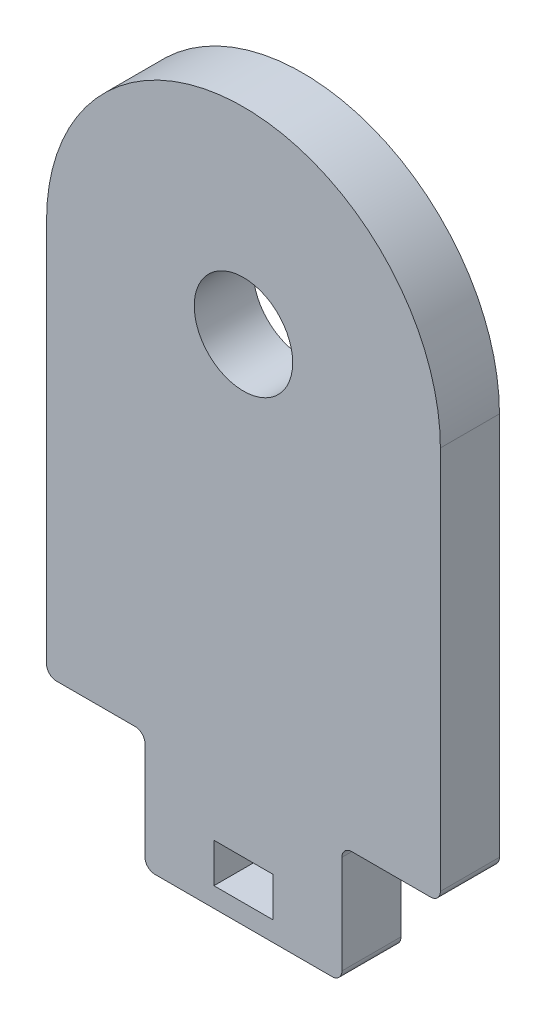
from build123d import *

# Parameters (mm, degrees)
SKETCH1_W           = 6
SKETCH1_H           = 4
BOSS_EXTRUDE1_DEPTH = 6
FILLET1_R           = 1
SKETCH2_R           = 5
CUT_EXTRUDE1_DEPTH  = 75.966659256


with BuildPart() as part:
    # Sketch1 → Boss-Extrude1 (new body)
    with BuildSketch(Plane.XY):
        with BuildLine():
            Line((-10, 0), (10, 0))
            Line((10, 0), (10, 12))
            Line((10, 12), (20, 12))
            Line((20, 12), (20, 52))
            ThreePointArc((20, 52), (0, 72), (-20, 52))
            Line((-20, 52), (-20, 12))
            Line((-20, 12), (-10, 12))
            Line((-10, 12), (-10, 0))
        make_face()
        with Locations((0, 4)):
            Rectangle(SKETCH1_W, SKETCH1_H, mode=Mode.SUBTRACT)
    extrude(amount=BOSS_EXTRUDE1_DEPTH)

    # Fillet1
    fillet1_edges = [part.edges().sort_by_distance(p)[0] for p in [
        (10, 0, 3),
        (-10, 0, 3),
        (-10, 12, 3),
        (-20, 12, 3),
        (20, 12, 3),
        (10, 12, 3),
    ]]
    fillet(fillet1_edges, radius=FILLET1_R)

    # Sketch2 → Cut-Extrude1 (cut, through all)
    with BuildSketch(Plane.XY.offset(6)):
        with Locations((0, 52)):
            Circle(SKETCH2_R)
    extrude(amount=-CUT_EXTRUDE1_DEPTH, mode=Mode.SUBTRACT)


solid = part.part
